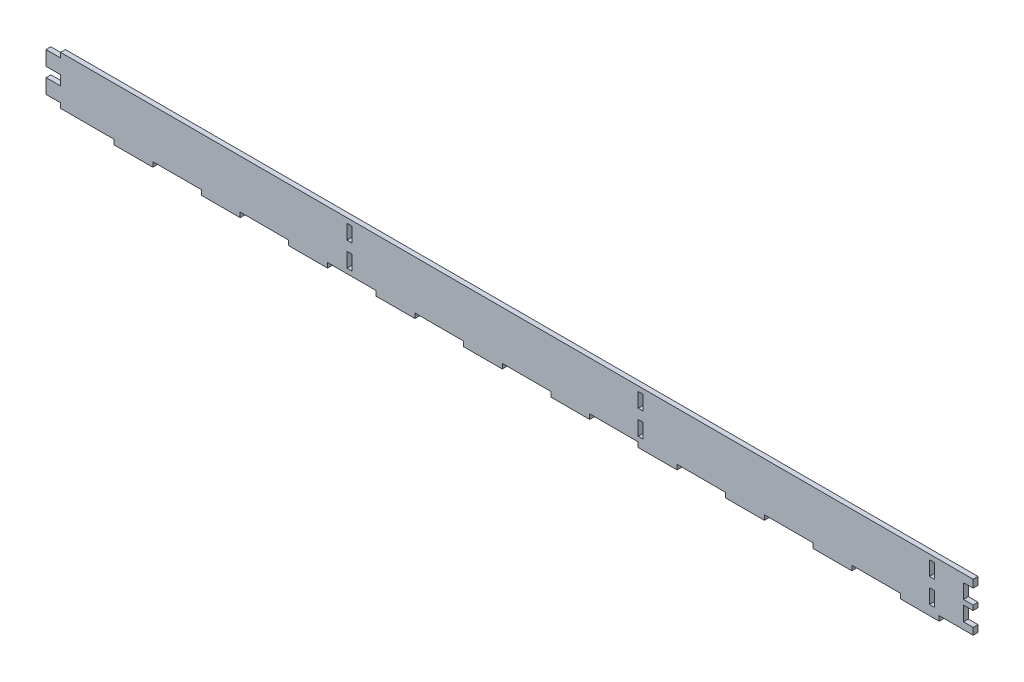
from build123d import *

# Parameters (mm, degrees)
MODEL_W             = 5
MODEL_H             = 15
BOSS_EXTRUDE1_DEPTH = 5
CUT_EXTRUDE1_DEPTH  = 902.401686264


with BuildPart() as part:
    # Model → Boss-Extrude1 (new body)
    with BuildSketch(Plane.XY):
        Polygon((-885, 0), (-830, 0), (-830, -5), (-790, -5), (-790, 0), (-740, 0), (-740, -5), (-700, -5), (-700, 0), (-650, 0), (-650, -5), (-610, -5), (-610, 0), (-560, 0), (-560, -5), (-520, -5), (-520, 0), (-470, 0), (-470, -5), (-430, -5), (-430, 0), (-380, 0), (-380, -5), (-340, -5), (-340, 0), (-290, 0), (-290, -5), (-250, -5), (-250, 0), (-200, 0), (-200, -5), (-160, -5), (-160, 0), (-110, 0), (-110, -5), (-70, -5), (-70, 0), (-20, 0), (-20, -5), (20, -5), (20, 0), (70, 0), (70, -5), (110, -5), (110, 0), (160, 0), (160, -5), (200, -5), (200, 0), (250, 0), (250, -5), (290, -5), (290, 0), (340, 0), (340, -5), (380, -5), (380, 0), (430, 0), (430, -5), (470, -5), (470, 0), (520, 0), (520, -5), (560, -5), (560, 0), (610, 0), (610, -5), (650, -5), (650, 0), (700, 0), (700, -5), (740, -5), (740, 0), (790, 0), (790, -5), (830, -5), (830, 0), (885, 0), (885, 5), (900, 5), (900, 20), (885, 20), (885, 30), (900, 30), (900, 45), (885, 45), (885, 50), (-885, 50), (-885, 45), (-900, 45), (-900, 30), (-885, 30), (-885, 20), (-900, 20), (-900, 5), (-885, 5), align=None)
        with Locations((-587.5, 12.5)):
            Rectangle(MODEL_W, MODEL_H, mode=Mode.SUBTRACT)
        with Locations((612.5, 12.5)):
            Rectangle(MODEL_W, MODEL_H, mode=Mode.SUBTRACT)
        with Locations((-587.5, 37.5)):
            Rectangle(MODEL_W, MODEL_H, mode=Mode.SUBTRACT)
        with Locations((612.5, 37.5)):
            Rectangle(MODEL_W, MODEL_H, mode=Mode.SUBTRACT)
        with Locations((312.5, 12.5)):
            Rectangle(MODEL_W, MODEL_H, mode=Mode.SUBTRACT)
        with Locations((312.5, 37.5)):
            Rectangle(MODEL_W, MODEL_H, mode=Mode.SUBTRACT)
        with Locations((12.5, 12.5)):
            Rectangle(MODEL_W, MODEL_H, mode=Mode.SUBTRACT)
        with Locations((12.5, 37.5)):
            Rectangle(MODEL_W, MODEL_H, mode=Mode.SUBTRACT)
        with Locations((-287.5, 12.5)):
            Rectangle(MODEL_W, MODEL_H, mode=Mode.SUBTRACT)
        with Locations((-287.5, 37.5)):
            Rectangle(MODEL_W, MODEL_H, mode=Mode.SUBTRACT)
    extrude(amount=BOSS_EXTRUDE1_DEPTH)

    # Sketch1 → Cut-Extrude1 (cut, through all)
    with BuildSketch(Plane.XY.offset(5)):
        Polygon((55, 50), (55, 42), (45, 42), (45, 27), (55, 27), (55, 22), (45, 22), (45, 7), (55, 7), (55, 0), (770.761926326, -361.957856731), (1126.301820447, 127.754431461), align=None)
    extrude(amount=-CUT_EXTRUDE1_DEPTH, mode=Mode.SUBTRACT)


solid = part.part
